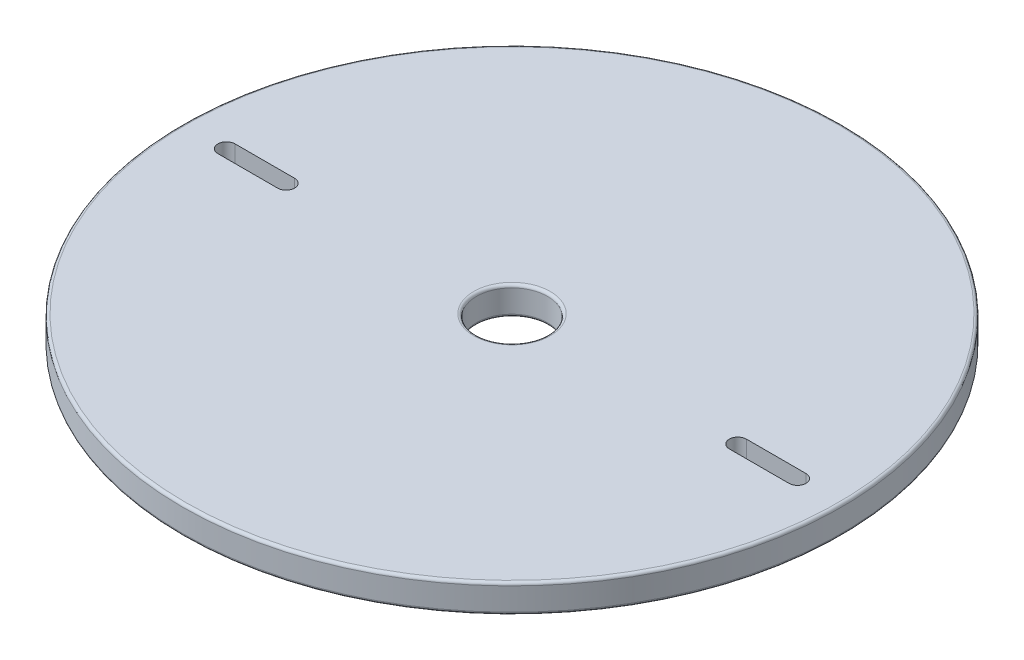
from build123d import *

# Parameters (mm, degrees)
SKETCH1_R           = 11.6
BOSS_EXTRUDE1_DEPTH = 0.5
CUT_EXTRUDE1_REACH  = 18.435
CUT_EXTRUDE2_REACH  = 18.435
SKETCH3_R           = 1.25
FILLET1_R           = 0.1


with BuildPart() as part:
    # Sketch1 → Boss-Extrude1 (new, symmetric)
    with BuildSketch(Plane(origin=(0, 0, 0), x_dir=(1, 0, 0), z_dir=(0, 1, 0))):
        with Locations(Location((0, 0, 0), (0, 0, 270))):
            Circle(SKETCH1_R)
    extrude(amount=BOSS_EXTRUDE1_DEPTH, both=True)

    # Sketch2 → Cut-Extrude1 (cut, up to next)
    with BuildSketch(Plane(origin=(0, 0.5, 0), x_dir=(1, 0, 0), z_dir=(0, 1, 0)), mode=Mode.PRIVATE) as cut_extrude1_sk1:
        with BuildLine():
            Line((-10.05, 0.3), (-7.95, 0.3))
            ThreePointArc((-7.95, 0.3), (-7.65, 0), (-7.95, -0.3))
            Line((-7.95, -0.3), (-10.05, -0.3))
            ThreePointArc((-10.05, -0.3), (-10.35, 0), (-10.05, 0.3))
        make_face()
    cut_extrude1_tool1 = extrude(cut_extrude1_sk1.sketch, amount=-CUT_EXTRUDE1_REACH, mode=Mode.PRIVATE) & part.part
    cut_extrude1 = cut_extrude1_tool1.solids().sort_by_distance((-9, 0.5, 0))[0]
    add(cut_extrude1, mode=Mode.SUBTRACT)

    # Mirror1: Cut-Extrude1 across plane
    add(cut_extrude1.mirror(Plane(origin=(0, 0, 0), x_dir=(0, 0, 1), z_dir=(1, 0, 0))), mode=Mode.SUBTRACT)

    # Sketch3 → Cut-Extrude2 (cut, up to next)
    with BuildSketch(Plane(origin=(0, 0.5, 0), x_dir=(1, 0, 0), z_dir=(0, 1, 0)), mode=Mode.PRIVATE) as cut_extrude2_sk1:
        with Locations(Location((0, 0, 0), (0, 0, 270))):
            Circle(SKETCH3_R)
    cut_extrude2_tool1 = extrude(cut_extrude2_sk1.sketch, amount=-CUT_EXTRUDE2_REACH, mode=Mode.PRIVATE) & part.part
    add(cut_extrude2_tool1.solids().sort_by_distance((0, 0.5, 0))[0], mode=Mode.SUBTRACT)

    # Fillet1
    fillet1_edges = [part.edges().sort_by_distance(p)[0] for p in [
        (0, -0.5, -11.6),
        (0, 0.5, -1.25),
        (0, -0.5, -1.25),
        (0, 0.5, -11.6),
    ]]
    fillet(fillet1_edges, radius=FILLET1_R)


solid = part.part
